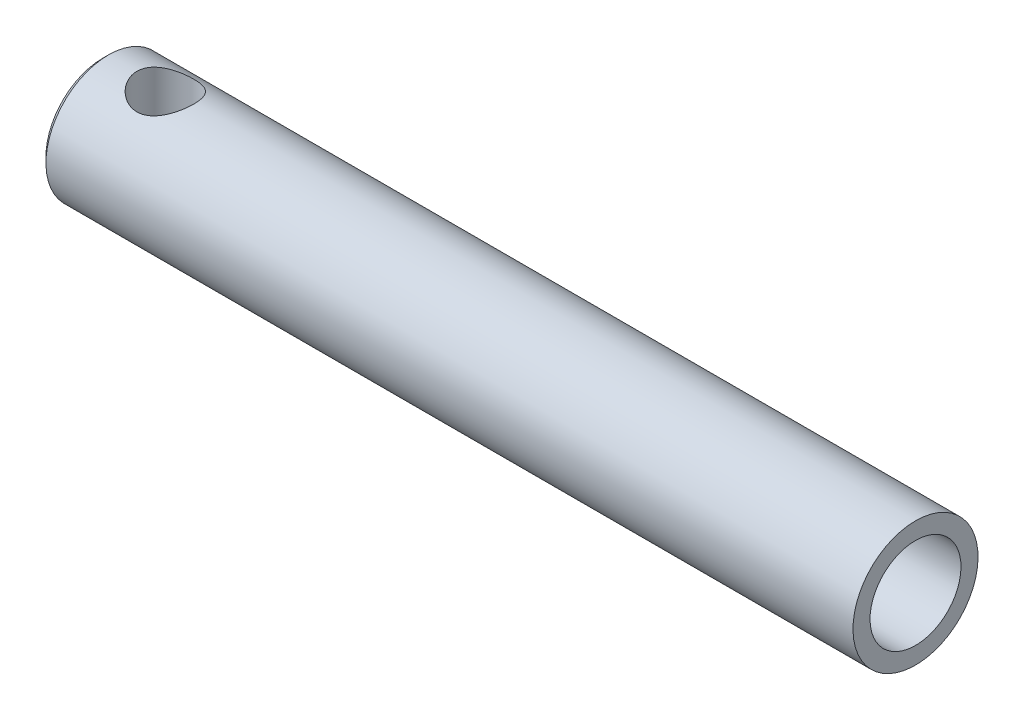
ISO-10303-21;
HEADER;
FILE_DESCRIPTION(('STEP AP214'),'2;1');
FILE_NAME('part.step','',(''),(''),'','','');
FILE_SCHEMA(('AUTOMOTIVE_DESIGN { 1 0 10303 214 1 1 1 1 }'));
ENDSEC;
DATA;
#1=APPLICATION_CONTEXT('core data for automotive mechanical design processes');
#2=APPLICATION_PROTOCOL_DEFINITION('international standard','automotive_design',2000,#1);
#3=PRODUCT_CONTEXT('',#1,'mechanical');
#4=PRODUCT('Part','Part','',(#3));
#5=PRODUCT_RELATED_PRODUCT_CATEGORY('part','',(#4));
#6=PRODUCT_DEFINITION_FORMATION('','',#4);
#7=PRODUCT_DEFINITION_CONTEXT('part definition',#1,'design');
#8=PRODUCT_DEFINITION('design','',#6,#7);
#9=PRODUCT_DEFINITION_SHAPE('','',#8);
#10=(LENGTH_UNIT() NAMED_UNIT(*) SI_UNIT(.MILLI.,.METRE.));
#11=(NAMED_UNIT(*) PLANE_ANGLE_UNIT() SI_UNIT($,.RADIAN.));
#12=(NAMED_UNIT(*) SI_UNIT($,.STERADIAN.) SOLID_ANGLE_UNIT());
#13=UNCERTAINTY_MEASURE_WITH_UNIT(LENGTH_MEASURE(1.E-05),#10,'distance_accuracy_value','');
#14=(GEOMETRIC_REPRESENTATION_CONTEXT(3) GLOBAL_UNCERTAINTY_ASSIGNED_CONTEXT((#13)) GLOBAL_UNIT_ASSIGNED_CONTEXT((#10,
#11,#12)) REPRESENTATION_CONTEXT('',''));
#15=CARTESIAN_POINT('',(0.,0.,0.));
#16=DIRECTION('',(0.,0.,1.));
#17=DIRECTION('',(1.,0.,0.));
#18=AXIS2_PLACEMENT_3D('',#15,#16,#17);
#19=CARTESIAN_POINT('',(-21.0563492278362,0.,0.));
#20=DIRECTION('',(1.,0.,0.));
#21=DIRECTION('',(0.,1.,0.));
#22=AXIS2_PLACEMENT_3D('',#19,#20,#21);
#23=CYLINDRICAL_SURFACE('',#22,5.5);
#24=CARTESIAN_POINT('',(0.,4.89897948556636,-2.5));
#25=CARTESIAN_POINT('',(0.132217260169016,4.89898526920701,-2.49999510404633));
#26=CARTESIAN_POINT('',(0.264479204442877,4.90440244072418,-2.48945897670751));
#27=CARTESIAN_POINT('',(0.524947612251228,4.92530735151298,-2.44782826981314));
#28=CARTESIAN_POINT('',(0.653150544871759,4.94080361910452,-2.41671627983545));
#29=CARTESIAN_POINT('',(0.901461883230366,4.97972155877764,-2.33546010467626));
#30=CARTESIAN_POINT('',(1.02160019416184,5.00311176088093,-2.28539139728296));
#31=CARTESIAN_POINT('',(1.25178995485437,5.05513375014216,-2.16788798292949));
#32=CARTESIAN_POINT('',(1.36183894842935,5.08376680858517,-2.10044906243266));
#33=CARTESIAN_POINT('',(1.57689176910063,5.14541163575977,-1.94478719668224));
#34=CARTESIAN_POINT('',(1.68105683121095,5.17858842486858,-1.85547047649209));
#35=CARTESIAN_POINT('',(1.87357164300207,5.24424149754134,-1.66086517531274));
#36=CARTESIAN_POINT('',(1.96191371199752,5.27671743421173,-1.55556888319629));
#37=CARTESIAN_POINT('',(2.12488200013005,5.33939687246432,-1.32508286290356));
#38=CARTESIAN_POINT('',(2.19851634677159,5.36938454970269,-1.19912828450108));
#39=CARTESIAN_POINT('',(2.3231245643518,5.42159485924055,-0.935060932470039));
#40=CARTESIAN_POINT('',(2.37412708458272,5.44382730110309,-0.796963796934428));
#41=CARTESIAN_POINT('',(2.44150956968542,5.47360217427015,-0.548774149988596));
#42=CARTESIAN_POINT('',(2.46338102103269,5.48343677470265,-0.440419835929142));
#43=CARTESIAN_POINT('',(2.4926266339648,5.49663662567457,-0.221386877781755));
#44=CARTESIAN_POINT('',(2.50000368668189,5.5000031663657,-0.110708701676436));
#45=CARTESIAN_POINT('',(2.49999557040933,5.49999619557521,0.133017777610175));
#46=CARTESIAN_POINT('',(2.4893360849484,5.49512778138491,0.266079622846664));
#47=CARTESIAN_POINT('',(2.44717025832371,5.47615723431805,0.528215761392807));
#48=CARTESIAN_POINT('',(2.4156497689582,5.46204883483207,0.657287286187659));
#49=CARTESIAN_POINT('',(2.3332022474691,5.42609129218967,0.907450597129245));
#50=CARTESIAN_POINT('',(2.28233315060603,5.40426527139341,1.02856495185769));
#51=CARTESIAN_POINT('',(2.162935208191,5.35493594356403,1.26044995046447));
#52=CARTESIAN_POINT('',(2.09440354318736,5.32743173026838,1.37121893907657));
#53=CARTESIAN_POINT('',(1.93751642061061,5.26767870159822,1.58575038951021));
#54=CARTESIAN_POINT('',(1.84831086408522,5.23525686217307,1.68884229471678));
#55=CARTESIAN_POINT('',(1.65440586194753,5.16998337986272,1.87920696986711));
#56=CARTESIAN_POINT('',(1.54969601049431,5.13713146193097,1.96646902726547));
#57=CARTESIAN_POINT('',(1.32001136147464,5.07243162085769,2.12802109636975));
#58=CARTESIAN_POINT('',(1.19418661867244,5.04076948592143,2.20118427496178));
#59=CARTESIAN_POINT('',(0.930445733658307,4.98490068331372,2.32495508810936));
#60=CARTESIAN_POINT('',(0.792546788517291,4.96068362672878,2.37559419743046));
#61=CARTESIAN_POINT('',(0.54522759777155,4.92811570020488,2.44226597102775));
#62=CARTESIAN_POINT('',(0.437606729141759,4.91728590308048,2.46384991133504));
#63=CARTESIAN_POINT('',(0.220000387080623,4.90271649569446,2.49271673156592));
#64=CARTESIAN_POINT('',(0.110015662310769,4.89897467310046,2.50000407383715));
#65=CARTESIAN_POINT('',(-0.132217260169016,4.89898526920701,2.49999510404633));
#66=CARTESIAN_POINT('',(-0.264479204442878,4.90440244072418,2.48945897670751));
#67=CARTESIAN_POINT('',(-0.52494761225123,4.92530735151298,2.44782826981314));
#68=CARTESIAN_POINT('',(-0.65315054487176,4.94080361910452,2.41671627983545));
#69=CARTESIAN_POINT('',(-0.901461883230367,4.97972155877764,2.33546010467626));
#70=CARTESIAN_POINT('',(-1.02160019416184,5.00311176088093,2.28539139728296));
#71=CARTESIAN_POINT('',(-1.25178995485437,5.05513375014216,2.16788798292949));
#72=CARTESIAN_POINT('',(-1.36183894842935,5.08376680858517,2.10044906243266));
#73=CARTESIAN_POINT('',(-1.57689176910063,5.14541163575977,1.94478719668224));
#74=CARTESIAN_POINT('',(-1.68105683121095,5.17858842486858,1.85547047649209));
#75=CARTESIAN_POINT('',(-1.87357164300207,5.24424149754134,1.66086517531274));
#76=CARTESIAN_POINT('',(-1.96191371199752,5.27671743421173,1.55556888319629));
#77=CARTESIAN_POINT('',(-2.12488200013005,5.33939687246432,1.32508286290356));
#78=CARTESIAN_POINT('',(-2.19851634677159,5.36938454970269,1.19912828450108));
#79=CARTESIAN_POINT('',(-2.3231245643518,5.42159485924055,0.935060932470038));
#80=CARTESIAN_POINT('',(-2.37412708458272,5.44382730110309,0.796963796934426));
#81=CARTESIAN_POINT('',(-2.44150956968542,5.47360217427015,0.548774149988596));
#82=CARTESIAN_POINT('',(-2.46338102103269,5.48343677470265,0.440419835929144));
#83=CARTESIAN_POINT('',(-2.4926266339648,5.49663662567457,0.221386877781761));
#84=CARTESIAN_POINT('',(-2.50000368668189,5.5000031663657,0.110708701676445));
#85=CARTESIAN_POINT('',(-2.49999557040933,5.49999619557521,-0.133017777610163));
#86=CARTESIAN_POINT('',(-2.4893360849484,5.49512778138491,-0.266079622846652));
#87=CARTESIAN_POINT('',(-2.44717025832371,5.47615723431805,-0.528215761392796));
#88=CARTESIAN_POINT('',(-2.4156497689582,5.46204883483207,-0.657287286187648));
#89=CARTESIAN_POINT('',(-2.3332022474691,5.42609129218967,-0.907450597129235));
#90=CARTESIAN_POINT('',(-2.28233315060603,5.40426527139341,-1.02856495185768));
#91=CARTESIAN_POINT('',(-2.162935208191,5.35493594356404,-1.26044995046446));
#92=CARTESIAN_POINT('',(-2.09440354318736,5.32743173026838,-1.37121893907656));
#93=CARTESIAN_POINT('',(-1.93751642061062,5.26767870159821,-1.5857503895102));
#94=CARTESIAN_POINT('',(-1.84831086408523,5.23525686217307,-1.68884229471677));
#95=CARTESIAN_POINT('',(-1.65440586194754,5.16998337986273,-1.8792069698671));
#96=CARTESIAN_POINT('',(-1.54969601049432,5.13713146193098,-1.96646902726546));
#97=CARTESIAN_POINT('',(-1.32001136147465,5.07243162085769,-2.12802109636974));
#98=CARTESIAN_POINT('',(-1.19418661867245,5.04076948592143,-2.20118427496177));
#99=CARTESIAN_POINT('',(-0.930445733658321,4.98490068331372,-2.32495508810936));
#100=CARTESIAN_POINT('',(-0.792546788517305,4.96068362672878,-2.37559419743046));
#101=CARTESIAN_POINT('',(-0.545227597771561,4.92811570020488,-2.44226597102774));
#102=CARTESIAN_POINT('',(-0.437606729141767,4.91728590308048,-2.46384991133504));
#103=CARTESIAN_POINT('',(-0.220000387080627,4.90271649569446,-2.49271673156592));
#104=CARTESIAN_POINT('',(-0.110015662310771,4.89897467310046,-2.50000407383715));
#105=CARTESIAN_POINT('',(0.,4.89897948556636,-2.5));
#106=B_SPLINE_CURVE_WITH_KNOTS('',3,(#24,#25,#26,#27,#28,#29,#30,#31,#32,#33,#34,#35,#36,#37,
#38,#39,#40,#41,#42,#43,#44,#45,#46,#47,#48,#49,#50,#51,#52,#53,#54,#55,#56,#57,#58,#59,#60,#61,
#62,#63,#64,#65,#66,#67,#68,#69,#70,#71,#72,#73,#74,#75,#76,#77,#78,#79,#80,#81,#82,#83,#84,#85,
#86,#87,#88,#89,#90,#91,#92,#93,#94,#95,#96,#97,#98,#99,#100,#101,#102,#103,#104,#105),
.UNSPECIFIED.,.T.,.F.,(4,2,2,2,2,2,2,2,2,2,2,2,2,2,2,2,2,2,2,2,2,2,2,2,2,2,2,2,2,2,2,2,2,2,2,2,
2,2,2,2,4),(0.,0.396219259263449,0.792774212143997,1.18776657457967,1.58285484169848,
2.00454809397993,2.42644549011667,2.87100932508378,3.31500877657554,3.6468472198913,
3.97861946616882,4.37724763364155,4.77614643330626,5.17386010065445,5.57163729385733,
5.99024239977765,6.40912974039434,6.8537610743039,7.29776912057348,7.6275591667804,
7.9572462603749,8.35346551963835,8.7500204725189,9.14501283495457,9.54010110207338,
9.96179435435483,10.3836917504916,10.8282555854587,11.2722550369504,11.6040934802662,
11.9358657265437,12.3344938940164,12.7333926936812,13.1311063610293,13.5288835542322,
13.9474886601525,14.3663760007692,14.8110073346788,15.2550153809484,15.5848054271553,
15.9144925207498),.UNSPECIFIED.);
#107=CARTESIAN_POINT('',(0.,4.89897948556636,-2.5));
#108=VERTEX_POINT('',#107);
#109=EDGE_CURVE('E10',#108,#108,#106,.T.);
#110=ORIENTED_EDGE('',*,*,#109,.T.);
#111=EDGE_LOOP('',(#110));
#112=FACE_BOUND('',#111,.T.);
#113=CARTESIAN_POINT('',(-2.5,-5.5,0.));
#114=CARTESIAN_POINT('',(-2.49999557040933,-5.49999619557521,0.133017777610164));
#115=CARTESIAN_POINT('',(-2.4893360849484,-5.49512778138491,0.266079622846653));
#116=CARTESIAN_POINT('',(-2.44717025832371,-5.47615723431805,0.528215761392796));
#117=CARTESIAN_POINT('',(-2.4156497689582,-5.46204883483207,0.657287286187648));
#118=CARTESIAN_POINT('',(-2.3332022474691,-5.42609129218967,0.907450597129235));
#119=CARTESIAN_POINT('',(-2.28233315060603,-5.40426527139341,1.02856495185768));
#120=CARTESIAN_POINT('',(-2.162935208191,-5.35493594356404,1.26044995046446));
#121=CARTESIAN_POINT('',(-2.09440354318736,-5.32743173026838,1.37121893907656));
#122=CARTESIAN_POINT('',(-1.93751642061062,-5.26767870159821,1.5857503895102));
#123=CARTESIAN_POINT('',(-1.84831086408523,-5.23525686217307,1.68884229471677));
#124=CARTESIAN_POINT('',(-1.65440586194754,-5.16998337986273,1.8792069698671));
#125=CARTESIAN_POINT('',(-1.54969601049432,-5.13713146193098,1.96646902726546));
#126=CARTESIAN_POINT('',(-1.32001136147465,-5.07243162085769,2.12802109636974));
#127=CARTESIAN_POINT('',(-1.19418661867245,-5.04076948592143,2.20118427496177));
#128=CARTESIAN_POINT('',(-0.93044573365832,-4.98490068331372,2.32495508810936));
#129=CARTESIAN_POINT('',(-0.792546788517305,-4.96068362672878,2.37559419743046));
#130=CARTESIAN_POINT('',(-0.545227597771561,-4.92811570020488,2.44226597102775));
#131=CARTESIAN_POINT('',(-0.437606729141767,-4.91728590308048,2.46384991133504));
#132=CARTESIAN_POINT('',(-0.220000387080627,-4.90271649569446,2.49271673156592));
#133=CARTESIAN_POINT('',(-0.11001566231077,-4.89897467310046,2.50000407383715));
#134=CARTESIAN_POINT('',(0.132217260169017,-4.89898526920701,2.49999510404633));
#135=CARTESIAN_POINT('',(0.264479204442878,-4.90440244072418,2.48945897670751));
#136=CARTESIAN_POINT('',(0.52494761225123,-4.92530735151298,2.44782826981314));
#137=CARTESIAN_POINT('',(0.653150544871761,-4.94080361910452,2.41671627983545));
#138=CARTESIAN_POINT('',(0.901461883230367,-4.97972155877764,2.33546010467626));
#139=CARTESIAN_POINT('',(1.02160019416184,-5.00311176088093,2.28539139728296));
#140=CARTESIAN_POINT('',(1.25178995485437,-5.05513375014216,2.16788798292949));
#141=CARTESIAN_POINT('',(1.36183894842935,-5.08376680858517,2.10044906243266));
#142=CARTESIAN_POINT('',(1.57689176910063,-5.14541163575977,1.94478719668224));
#143=CARTESIAN_POINT('',(1.68105683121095,-5.17858842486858,1.85547047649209));
#144=CARTESIAN_POINT('',(1.87357164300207,-5.24424149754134,1.66086517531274));
#145=CARTESIAN_POINT('',(1.96191371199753,-5.27671743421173,1.55556888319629));
#146=CARTESIAN_POINT('',(2.12488200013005,-5.33939687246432,1.32508286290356));
#147=CARTESIAN_POINT('',(2.19851634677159,-5.36938454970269,1.19912828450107));
#148=CARTESIAN_POINT('',(2.3231245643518,-5.42159485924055,0.935060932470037));
#149=CARTESIAN_POINT('',(2.37412708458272,-5.44382730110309,0.796963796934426));
#150=CARTESIAN_POINT('',(2.44150956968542,-5.47360217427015,0.548774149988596));
#151=CARTESIAN_POINT('',(2.46338102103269,-5.48343677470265,0.440419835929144));
#152=CARTESIAN_POINT('',(2.4926266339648,-5.49663662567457,0.221386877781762));
#153=CARTESIAN_POINT('',(2.50000368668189,-5.5000031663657,0.110708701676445));
#154=CARTESIAN_POINT('',(2.49999557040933,-5.49999619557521,-0.133017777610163));
#155=CARTESIAN_POINT('',(2.4893360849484,-5.49512778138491,-0.266079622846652));
#156=CARTESIAN_POINT('',(2.44717025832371,-5.47615723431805,-0.528215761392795));
#157=CARTESIAN_POINT('',(2.4156497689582,-5.46204883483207,-0.657287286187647));
#158=CARTESIAN_POINT('',(2.3332022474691,-5.42609129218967,-0.907450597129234));
#159=CARTESIAN_POINT('',(2.28233315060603,-5.40426527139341,-1.02856495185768));
#160=CARTESIAN_POINT('',(2.162935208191,-5.35493594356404,-1.26044995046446));
#161=CARTESIAN_POINT('',(2.09440354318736,-5.32743173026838,-1.37121893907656));
#162=CARTESIAN_POINT('',(1.93751642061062,-5.26767870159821,-1.5857503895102));
#163=CARTESIAN_POINT('',(1.84831086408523,-5.23525686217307,-1.68884229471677));
#164=CARTESIAN_POINT('',(1.65440586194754,-5.16998337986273,-1.8792069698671));
#165=CARTESIAN_POINT('',(1.54969601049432,-5.13713146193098,-1.96646902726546));
#166=CARTESIAN_POINT('',(1.32001136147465,-5.0724316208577,-2.12802109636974));
#167=CARTESIAN_POINT('',(1.19418661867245,-5.04076948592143,-2.20118427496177));
#168=CARTESIAN_POINT('',(0.930445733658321,-4.98490068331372,-2.32495508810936));
#169=CARTESIAN_POINT('',(0.792546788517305,-4.96068362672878,-2.37559419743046));
#170=CARTESIAN_POINT('',(0.545227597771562,-4.92811570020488,-2.44226597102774));
#171=CARTESIAN_POINT('',(0.437606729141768,-4.91728590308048,-2.46384991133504));
#172=CARTESIAN_POINT('',(0.220000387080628,-4.90271649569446,-2.49271673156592));
#173=CARTESIAN_POINT('',(0.110015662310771,-4.89897467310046,-2.50000407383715));
#174=CARTESIAN_POINT('',(-0.132217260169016,-4.89898526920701,-2.49999510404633));
#175=CARTESIAN_POINT('',(-0.264479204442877,-4.90440244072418,-2.48945897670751));
#176=CARTESIAN_POINT('',(-0.524947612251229,-4.92530735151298,-2.44782826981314));
#177=CARTESIAN_POINT('',(-0.65315054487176,-4.94080361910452,-2.41671627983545));
#178=CARTESIAN_POINT('',(-0.901461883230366,-4.97972155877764,-2.33546010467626));
#179=CARTESIAN_POINT('',(-1.02160019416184,-5.00311176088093,-2.28539139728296));
#180=CARTESIAN_POINT('',(-1.25178995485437,-5.05513375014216,-2.16788798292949));
#181=CARTESIAN_POINT('',(-1.36183894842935,-5.08376680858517,-2.10044906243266));
#182=CARTESIAN_POINT('',(-1.57689176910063,-5.14541163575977,-1.94478719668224));
#183=CARTESIAN_POINT('',(-1.68105683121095,-5.17858842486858,-1.85547047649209));
#184=CARTESIAN_POINT('',(-1.87357164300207,-5.24424149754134,-1.66086517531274));
#185=CARTESIAN_POINT('',(-1.96191371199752,-5.27671743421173,-1.55556888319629));
#186=CARTESIAN_POINT('',(-2.12488200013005,-5.33939687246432,-1.32508286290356));
#187=CARTESIAN_POINT('',(-2.19851634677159,-5.36938454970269,-1.19912828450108));
#188=CARTESIAN_POINT('',(-2.3231245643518,-5.42159485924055,-0.935060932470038));
#189=CARTESIAN_POINT('',(-2.37412708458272,-5.44382730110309,-0.796963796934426));
#190=CARTESIAN_POINT('',(-2.44150956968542,-5.47360217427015,-0.548774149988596));
#191=CARTESIAN_POINT('',(-2.46338102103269,-5.48343677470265,-0.440419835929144));
#192=CARTESIAN_POINT('',(-2.4926266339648,-5.49663662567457,-0.221386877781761));
#193=CARTESIAN_POINT('',(-2.50000368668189,-5.5000031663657,-0.110708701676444));
#194=CARTESIAN_POINT('',(-2.5,-5.5,0.));
#195=B_SPLINE_CURVE_WITH_KNOTS('',3,(#113,#114,#115,#116,#117,#118,#119,#120,#121,#122,#123,
#124,#125,#126,#127,#128,#129,#130,#131,#132,#133,#134,#135,#136,#137,#138,#139,#140,#141,#142,
#143,#144,#145,#146,#147,#148,#149,#150,#151,#152,#153,#154,#155,#156,#157,#158,#159,#160,#161,
#162,#163,#164,#165,#166,#167,#168,#169,#170,#171,#172,#173,#174,#175,#176,#177,#178,#179,#180,
#181,#182,#183,#184,#185,#186,#187,#188,#189,#190,#191,#192,#193,#194),.UNSPECIFIED.,.T.,.F.,(4,
2,2,2,2,2,2,2,2,2,2,2,2,2,2,2,2,2,2,2,2,2,2,2,2,2,2,2,2,2,2,2,2,2,2,2,2,2,2,2,4),(0.,
0.39862816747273,0.797526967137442,1.19524063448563,1.59301782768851,2.01162293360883,
2.43051027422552,2.87514160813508,3.31914965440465,3.64893970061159,3.97862679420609,
4.37484605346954,4.77140100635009,5.16639336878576,5.56148163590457,5.98317488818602,
6.40507228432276,6.84963611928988,7.29363557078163,7.62547401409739,7.9572462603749,
8.35587442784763,8.75477322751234,9.15248689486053,9.55026408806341,9.96886919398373,
10.3877565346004,10.83238786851,11.2763959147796,11.6061859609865,11.935873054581,
12.3320923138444,12.728647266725,13.1236396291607,13.5187278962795,13.9404211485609,
14.3623185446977,14.8068823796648,15.2508818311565,15.5827202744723,15.9144925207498),.UNSPECIFIED.);
#196=CARTESIAN_POINT('',(-2.5,-5.5,0.));
#197=VERTEX_POINT('',#196);
#198=EDGE_CURVE('E23',#197,#197,#195,.T.);
#199=ORIENTED_EDGE('',*,*,#198,.T.);
#200=EDGE_LOOP('',(#199));
#201=FACE_BOUND('',#200,.T.);
#202=CARTESIAN_POINT('',(-5.00000004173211,0.,0.));
#203=DIRECTION('',(1.,0.,0.));
#204=DIRECTION('',(0.,1.,0.));
#205=AXIS2_PLACEMENT_3D('',#202,#203,#204);
#206=CIRCLE('',#205,5.5);
#207=CARTESIAN_POINT('',(-5.00000004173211,5.5,0.));
#208=VERTEX_POINT('',#207);
#209=EDGE_CURVE('E28',#208,#208,#206,.T.);
#210=ORIENTED_EDGE('',*,*,#209,.T.);
#211=EDGE_LOOP('',(#210));
#212=FACE_BOUND('',#211,.T.);
#213=CARTESIAN_POINT('',(65.9999999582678,0.,0.));
#214=DIRECTION('',(1.,0.,0.));
#215=DIRECTION('',(0.,1.,0.));
#216=AXIS2_PLACEMENT_3D('',#213,#214,#215);
#217=CIRCLE('',#216,5.5);
#218=CARTESIAN_POINT('',(65.9999999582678,5.50000000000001,0.));
#219=VERTEX_POINT('',#218);
#220=EDGE_CURVE('E84',#219,#219,#217,.T.);
#221=ORIENTED_EDGE('',*,*,#220,.F.);
#222=EDGE_LOOP('',(#221));
#223=FACE_BOUND('',#222,.T.);
#224=ADVANCED_FACE('F15',(#112,#201,#212,#223),#23,.T.);
#225=CARTESIAN_POINT('',(-5.50000004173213,-5.37293515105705E-07,-1.69383534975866E-08));
#226=DIRECTION('',(1.,0.,0.));
#227=DIRECTION('',(0.,0.,-1.));
#228=AXIS2_PLACEMENT_3D('',#225,#226,#227);
#229=PLANE('',#228);
#230=CARTESIAN_POINT('',(-5.5000000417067,0.,0.));
#231=DIRECTION('',(1.,0.,0.));
#232=DIRECTION('',(0.,1.,0.));
#233=AXIS2_PLACEMENT_3D('',#230,#231,#232);
#234=CIRCLE('',#233,4.99999999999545);
#235=CARTESIAN_POINT('',(-5.5000000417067,4.99999999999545,0.));
#236=VERTEX_POINT('',#235);
#237=EDGE_CURVE('E85',#236,#236,#234,.T.);
#238=ORIENTED_EDGE('',*,*,#237,.F.);
#239=EDGE_LOOP('',(#238));
#240=FACE_BOUND('',#239,.T.);
#241=ADVANCED_FACE('F47',(#240),#229,.F.);
#242=CARTESIAN_POINT('',(0.,7.,0.));
#243=DIRECTION('',(0.,-1.,0.));
#244=DIRECTION('',(0.,0.,-1.));
#245=AXIS2_PLACEMENT_3D('',#242,#243,#244);
#246=CYLINDRICAL_SURFACE('',#245,2.5);
#247=ORIENTED_EDGE('',*,*,#198,.F.);
#248=EDGE_LOOP('',(#247));
#249=FACE_BOUND('',#248,.T.);
#250=ORIENTED_EDGE('',*,*,#109,.F.);
#251=EDGE_LOOP('',(#250));
#252=FACE_BOUND('',#251,.T.);
#253=ADVANCED_FACE('F41',(#249,#252),#246,.F.);
#254=CARTESIAN_POINT('',(-5.00000004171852,0.,0.));
#255=DIRECTION('',(1.,0.,0.));
#256=DIRECTION('',(0.,1.,0.));
#257=AXIS2_PLACEMENT_3D('',#254,#255,#256);
#258=CONICAL_SURFACE('',#257,5.49999999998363,0.785398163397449);
#259=ORIENTED_EDGE('',*,*,#237,.T.);
#260=EDGE_LOOP('',(#259));
#261=FACE_BOUND('',#260,.T.);
#262=ORIENTED_EDGE('',*,*,#209,.F.);
#263=EDGE_LOOP('',(#262));
#264=FACE_BOUND('',#263,.T.);
#265=ADVANCED_FACE('F48',(#261,#264),#258,.T.);
#266=CARTESIAN_POINT('',(65.9999999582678,0.,0.));
#267=DIRECTION('',(1.,0.,0.));
#268=DIRECTION('',(0.,1.,0.));
#269=AXIS2_PLACEMENT_3D('',#266,#267,#268);
#270=PLANE('',#269);
#271=ORIENTED_EDGE('',*,*,#220,.T.);
#272=EDGE_LOOP('',(#271));
#273=FACE_BOUND('',#272,.T.);
#274=CARTESIAN_POINT('',(65.9999999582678,-5.37293419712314E-07,-1.6938853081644E-08));
#275=DIRECTION('',(1.,0.,0.));
#276=DIRECTION('',(0.,1.,0.));
#277=AXIS2_PLACEMENT_3D('',#274,#275,#276);
#278=CIRCLE('',#277,4.);
#279=CARTESIAN_POINT('',(65.9999999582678,3.99999946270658,-1.6938853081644E-08));
#280=VERTEX_POINT('',#279);
#281=EDGE_CURVE('E19',#280,#280,#278,.F.);
#282=ORIENTED_EDGE('',*,*,#281,.T.);
#283=EDGE_LOOP('',(#282));
#284=FACE_BOUND('',#283,.T.);
#285=ADVANCED_FACE('F49',(#273,#284),#270,.T.);
#286=CARTESIAN_POINT('',(41.4999999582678,-5.37293424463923E-07,-1.69388518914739E-08));
#287=DIRECTION('',(1.,0.,0.));
#288=DIRECTION('',(0.,1.,0.));
#289=AXIS2_PLACEMENT_3D('',#286,#287,#288);
#290=PLANE('',#289);
#291=CARTESIAN_POINT('',(41.4999999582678,-5.37293422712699E-07,-1.69388522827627E-08));
#292=DIRECTION('',(1.,0.,0.));
#293=DIRECTION('',(0.,1.,0.));
#294=AXIS2_PLACEMENT_3D('',#291,#292,#293);
#295=CIRCLE('',#294,4.);
#296=CARTESIAN_POINT('',(41.4999999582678,3.99999946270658,-1.69388522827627E-08));
#297=VERTEX_POINT('',#296);
#298=EDGE_CURVE('E81',#297,#297,#295,.T.);
#299=ORIENTED_EDGE('',*,*,#298,.T.);
#300=EDGE_LOOP('',(#299));
#301=FACE_BOUND('',#300,.T.);
#302=ADVANCED_FACE('F17',(#301),#290,.T.);
#303=CARTESIAN_POINT('',(66.4999999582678,-5.37293419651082E-07,-1.69388530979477E-08));
#304=DIRECTION('',(1.,0.,0.));
#305=DIRECTION('',(0.,1.,0.));
#306=AXIS2_PLACEMENT_3D('',#303,#304,#305);
#307=CYLINDRICAL_SURFACE('',#306,4.);
#308=ORIENTED_EDGE('',*,*,#298,.F.);
#309=EDGE_LOOP('',(#308));
#310=FACE_BOUND('',#309,.T.);
#311=ORIENTED_EDGE('',*,*,#281,.F.);
#312=EDGE_LOOP('',(#311));
#313=FACE_BOUND('',#312,.T.);
#314=ADVANCED_FACE('F59',(#310,#313),#307,.F.);
#315=CLOSED_SHELL('',(#224,#241,#253,#265,#285,#302,#314));
#316=MANIFOLD_SOLID_BREP('B1',#315);
#317=ADVANCED_BREP_SHAPE_REPRESENTATION('',(#18,#316),#14);
#318=SHAPE_DEFINITION_REPRESENTATION(#9,#317);
ENDSEC;
END-ISO-10303-21;
